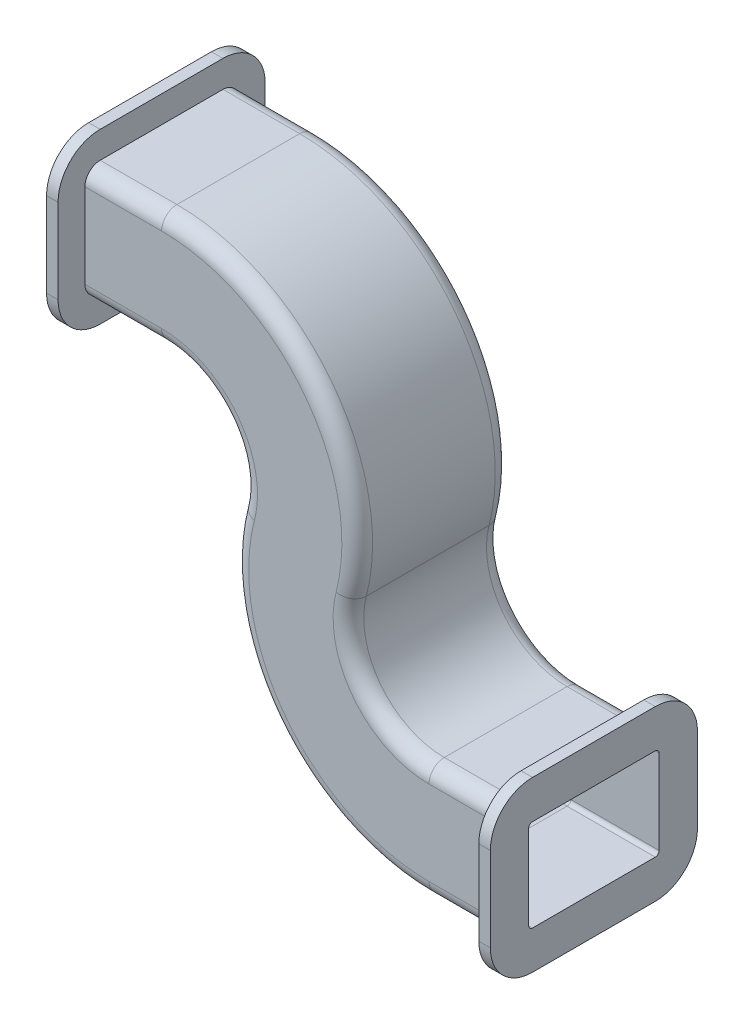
from build123d import *

# Parameters (mm, degrees)
BOSS_EXTRUDE1_DEPTH = 3.81
BOSS_EXTRUDE2_START = 3.81
BOSS_EXTRUDE2_DEPTH = 3.81


with BuildPart() as part:
    # Sweep-Thin1: sweep along a path in Sketch1
    with BuildLine(Plane.XY) as sweep_thin1_path:
        Line((0, 0), (25.4, 0))
        ThreePointArc((25.4, 0), (61.544833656, -17.72233224), (69.668199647, -57.15))
        ThreePointArc((69.668199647, -57.15), (77.791565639, -96.57766776), (113.936399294, -114.3))
        Line((113.936399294, -114.3), (139.336399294, -114.3))
    # Sketch2 → Sweep-Thin1 (sweep)
    with BuildSketch(Plane(origin=(0, 0, 0), x_dir=(0, 0, -1), z_dir=(1, 0, 0))):
        with BuildLine():
            Line((-25.4, 13.97), (-25.4, -13.97))
            ThreePointArc((-25.4, -13.97), (-23.912102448, -17.562102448), (-20.32, -19.05))
            Line((-20.32, -19.05), (20.32, -19.05))
            ThreePointArc((20.32, -19.05), (23.912102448, -17.562102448), (25.4, -13.97))
            Line((25.4, -13.97), (25.4, 13.97))
            ThreePointArc((25.4, 13.97), (23.912102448, 17.562102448), (20.32, 19.05))
            Line((20.32, 19.05), (-20.32, 19.05))
            ThreePointArc((-20.32, 19.05), (-23.912102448, 17.562102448), (-25.4, 13.97))
        make_face()
        with BuildLine():
            Line((-21.59, 13.97), (-21.59, -13.97))
            ThreePointArc((-21.59, -13.97), (-21.218025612, -14.868025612), (-20.32, -15.24))
            Line((-20.32, -15.24), (20.32, -15.24))
            ThreePointArc((20.32, -15.24), (21.218025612, -14.868025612), (21.59, -13.97))
            Line((21.59, -13.97), (21.59, 13.97))
            ThreePointArc((21.59, 13.97), (21.218025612, 14.868025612), (20.32, 15.24))
            Line((20.32, 15.24), (-20.32, 15.24))
            ThreePointArc((-20.32, 15.24), (-21.218025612, 14.868025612), (-21.59, 13.97))
        make_face(mode=Mode.SUBTRACT)
    sweep(path=sweep_thin1_path.line)

    # Sketch3 → Boss-Extrude1 (add)
    with BuildSketch(Plane.ZY):
        with BuildLine():
            Line((20.32, 27.94), (-20.32, 27.94))
            ThreePointArc((-20.32, 27.94), (-30.198281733, 23.848281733), (-34.29, 13.97))
            Line((-34.29, 13.97), (-34.29, -13.97))
            ThreePointArc((-34.29, -13.97), (-30.198281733, -23.848281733), (-20.32, -27.94))
            Line((-20.32, -27.94), (20.32, -27.94))
            ThreePointArc((20.32, -27.94), (30.198281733, -23.848281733), (34.29, -13.97))
            Line((34.29, -13.97), (34.29, 13.97))
            ThreePointArc((34.29, 13.97), (30.198281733, 23.848281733), (20.32, 27.94))
        make_face()
        with BuildLine():
            Line((20.32, -15.24), (-20.32, -15.24))
            ThreePointArc((-20.32, -15.24), (-21.218025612, -14.868025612), (-21.59, -13.97))
            Line((-21.59, -13.97), (-21.59, 13.97))
            ThreePointArc((-21.59, 13.97), (-21.218025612, 14.868025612), (-20.32, 15.24))
            Line((-20.32, 15.24), (20.32, 15.24))
            ThreePointArc((20.32, 15.24), (21.218025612, 14.868025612), (21.59, 13.97))
            Line((21.59, 13.97), (21.59, -13.97))
            ThreePointArc((21.59, -13.97), (21.218025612, -14.868025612), (20.32, -15.24))
        make_face(mode=Mode.SUBTRACT)
    extrude(amount=BOSS_EXTRUDE1_DEPTH)

    # Sketch4 → Boss-Extrude2 (add)
    with BuildSketch(Plane(origin=(139.336399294, 0, 0), x_dir=(0, 0, -1), z_dir=(1, 0, 0)).offset(BOSS_EXTRUDE2_START)):
        with BuildLine():
            Line((-20.32, -142.24), (20.32, -142.24))
            ThreePointArc((20.32, -142.24), (30.198281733, -138.148281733), (34.29, -128.27))
            Line((34.29, -128.27), (34.29, -100.33))
            ThreePointArc((34.29, -100.33), (30.198281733, -90.451718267), (20.32, -86.36))
            Line((20.32, -86.36), (-20.32, -86.36))
            ThreePointArc((-20.32, -86.36), (-30.198281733, -90.451718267), (-34.29, -100.33))
            Line((-34.29, -100.33), (-34.29, -128.27))
            ThreePointArc((-34.29, -128.27), (-30.198281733, -138.148281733), (-20.32, -142.24))
        make_face()
        with BuildLine():
            Line((21.59, -128.27), (21.59, -100.33))
            ThreePointArc((21.59, -100.33), (21.218025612, -99.431974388), (20.32, -99.06))
            Line((20.32, -99.06), (-20.32, -99.06))
            ThreePointArc((-20.32, -99.06), (-21.218025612, -99.431974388), (-21.59, -100.33))
            Line((-21.59, -100.33), (-21.59, -128.27))
            ThreePointArc((-21.59, -128.27), (-21.218025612, -129.168025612), (-20.32, -129.54))
            Line((-20.32, -129.54), (20.32, -129.54))
            ThreePointArc((20.32, -129.54), (21.218025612, -129.168025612), (21.59, -128.27))
        make_face(mode=Mode.SUBTRACT)
    extrude(amount=-BOSS_EXTRUDE2_DEPTH)


solid = part.part
